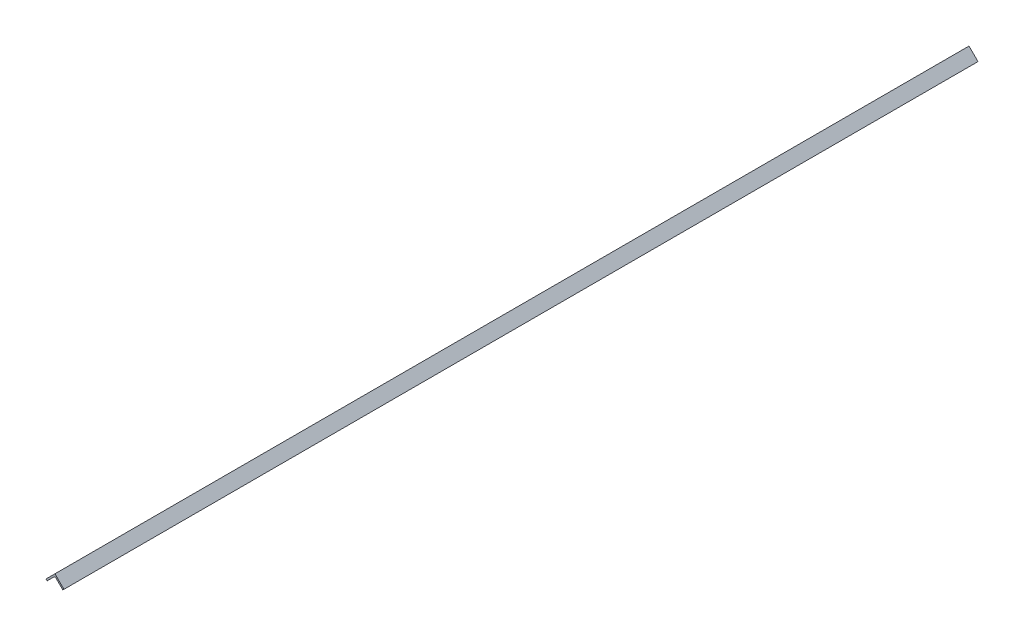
from build123d import *

# Parameters (mm, degrees)
BOSS_EXTRUDE1_DEPTH = 1828.8


with BuildPart() as part:
    # Sketch1 → Boss-Extrude1 (new body)
    with BuildSketch(Plane.XY):
        with BuildLine():
            Line((0, 0), (17.960512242, -17.960512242))
            Line((17.960512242, -17.960512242), (15.715448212, -20.205576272))
            Line((15.715448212, -20.205576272), (1.796051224, -6.286179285))
            ThreePointArc((1.796051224, -6.286179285), (0, -5.542230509), (-1.796051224, -6.286179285))
            Line((-1.796051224, -6.286179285), (-15.715448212, -20.205576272))
            Line((-15.715448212, -20.205576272), (-17.960512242, -17.960512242))
            Line((-17.960512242, -17.960512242), (0, 0))
        make_face()
    extrude(amount=-BOSS_EXTRUDE1_DEPTH)


solid = part.part
